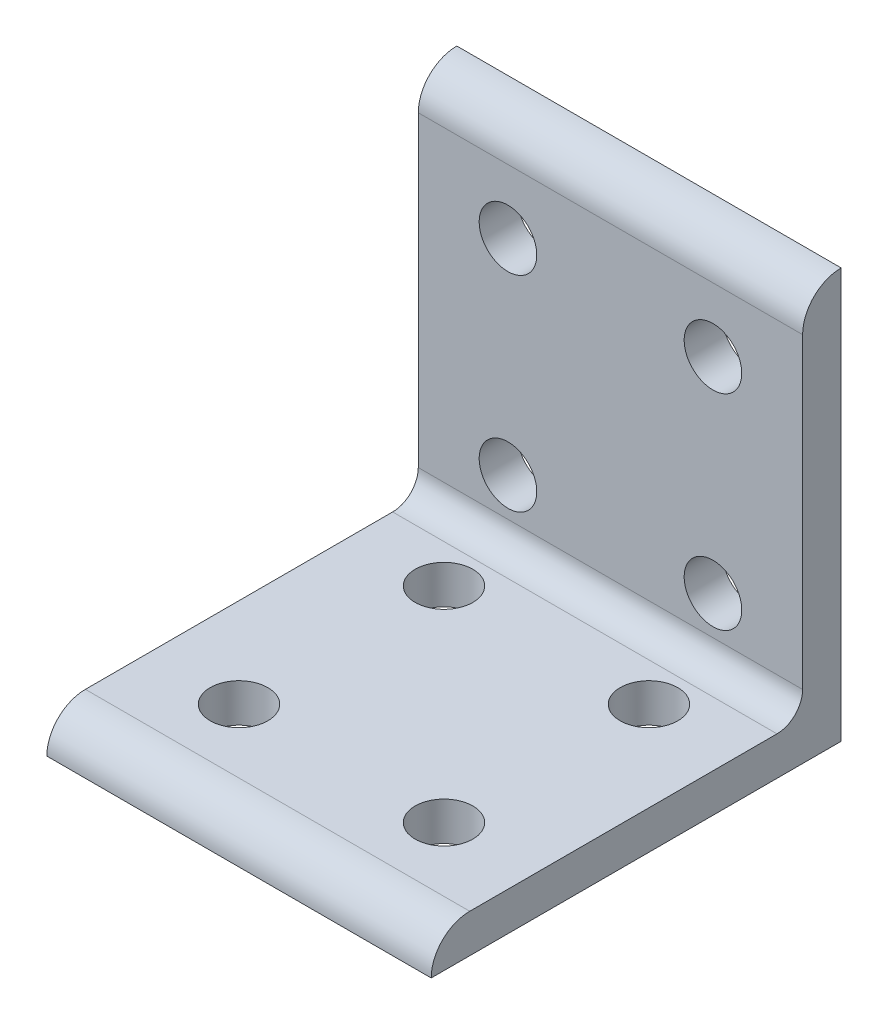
ISO-10303-21;
HEADER;
FILE_DESCRIPTION(('STEP AP214'),'2;1');
FILE_NAME('part.step','',(''),(''),'','','');
FILE_SCHEMA(('AUTOMOTIVE_DESIGN { 1 0 10303 214 1 1 1 1 }'));
ENDSEC;
DATA;
#1=APPLICATION_CONTEXT('core data for automotive mechanical design processes');
#2=APPLICATION_PROTOCOL_DEFINITION('international standard','automotive_design',2000,#1);
#3=PRODUCT_CONTEXT('',#1,'mechanical');
#4=PRODUCT('Part','Part','',(#3));
#5=PRODUCT_RELATED_PRODUCT_CATEGORY('part','',(#4));
#6=PRODUCT_DEFINITION_FORMATION('','',#4);
#7=PRODUCT_DEFINITION_CONTEXT('part definition',#1,'design');
#8=PRODUCT_DEFINITION('design','',#6,#7);
#9=PRODUCT_DEFINITION_SHAPE('','',#8);
#10=(LENGTH_UNIT() NAMED_UNIT(*) SI_UNIT(.MILLI.,.METRE.));
#11=(NAMED_UNIT(*) PLANE_ANGLE_UNIT() SI_UNIT($,.RADIAN.));
#12=(NAMED_UNIT(*) SI_UNIT($,.STERADIAN.) SOLID_ANGLE_UNIT());
#13=UNCERTAINTY_MEASURE_WITH_UNIT(LENGTH_MEASURE(1.E-05),#10,'distance_accuracy_value','');
#14=(GEOMETRIC_REPRESENTATION_CONTEXT(3) GLOBAL_UNCERTAINTY_ASSIGNED_CONTEXT((#13)) GLOBAL_UNIT_ASSIGNED_CONTEXT((#10,
#11,#12)) REPRESENTATION_CONTEXT('',''));
#15=CARTESIAN_POINT('',(0.,0.,0.));
#16=DIRECTION('',(0.,0.,1.));
#17=DIRECTION('',(1.,0.,0.));
#18=AXIS2_PLACEMENT_3D('',#15,#16,#17);
#19=CARTESIAN_POINT('',(23.8125,5.55111512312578E-13,0.));
#20=DIRECTION('',(0.,0.,1.));
#21=DIRECTION('',(1.,0.,0.));
#22=AXIS2_PLACEMENT_3D('',#19,#20,#21);
#23=PLANE('',#22);
#24=CARTESIAN_POINT('',(-12.7000000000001,38.1000000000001,2.77555756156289E-13));
#25=DIRECTION('',(0.,0.,1.));
#26=DIRECTION('',(1.,0.,0.));
#27=AXIS2_PLACEMENT_3D('',#24,#25,#26);
#28=CIRCLE('',#27,3.5687);
#29=CARTESIAN_POINT('',(-9.1313000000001,38.1000000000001,2.77555756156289E-13));
#30=VERTEX_POINT('',#29);
#31=EDGE_CURVE('E164',#30,#30,#28,.T.);
#32=ORIENTED_EDGE('',*,*,#31,.T.);
#33=EDGE_LOOP('',(#32));
#34=FACE_BOUND('',#33,.T.);
#35=CARTESIAN_POINT('',(12.7000000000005,38.1000000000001,2.77555756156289E-13));
#36=DIRECTION('',(0.,0.,1.));
#37=DIRECTION('',(1.,0.,0.));
#38=AXIS2_PLACEMENT_3D('',#35,#36,#37);
#39=CIRCLE('',#38,3.5687);
#40=CARTESIAN_POINT('',(16.2687000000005,38.1000000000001,2.77555756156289E-13));
#41=VERTEX_POINT('',#40);
#42=EDGE_CURVE('E119',#41,#41,#39,.T.);
#43=ORIENTED_EDGE('',*,*,#42,.T.);
#44=EDGE_LOOP('',(#43));
#45=FACE_BOUND('',#44,.T.);
#46=DIRECTION('',(-1.,0.,0.));
#47=VECTOR('',#46,1.);
#48=CARTESIAN_POINT('',(23.8125,5.55111512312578E-13,0.));
#49=LINE('',#48,#47);
#50=CARTESIAN_POINT('',(23.8125,5.55111512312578E-13,0.));
#51=VERTEX_POINT('',#50);
#52=CARTESIAN_POINT('',(-23.8125000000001,0.,0.));
#53=VERTEX_POINT('',#52);
#54=EDGE_CURVE('E44',#51,#53,#49,.T.);
#55=ORIENTED_EDGE('',*,*,#54,.T.);
#56=DIRECTION('',(0.,1.,0.));
#57=VECTOR('',#56,1.);
#58=CARTESIAN_POINT('',(-23.8125000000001,0.,0.));
#59=LINE('',#58,#57);
#60=CARTESIAN_POINT('',(-23.8125,50.8000000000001,0.));
#61=VERTEX_POINT('',#60);
#62=EDGE_CURVE('E113',#53,#61,#59,.T.);
#63=ORIENTED_EDGE('',*,*,#62,.T.);
#64=DIRECTION('',(-1.,0.,0.));
#65=VECTOR('',#64,1.);
#66=CARTESIAN_POINT('',(23.8125000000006,50.8000000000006,5.55111512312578E-13));
#67=LINE('',#66,#65);
#68=CARTESIAN_POINT('',(23.8125000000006,50.8000000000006,5.55111512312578E-13));
#69=VERTEX_POINT('',#68);
#70=EDGE_CURVE('E154',#69,#61,#67,.T.);
#71=ORIENTED_EDGE('',*,*,#70,.F.);
#72=DIRECTION('',(0.,1.,0.));
#73=VECTOR('',#72,1.);
#74=CARTESIAN_POINT('',(23.8125,5.55111512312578E-13,0.));
#75=LINE('',#74,#73);
#76=EDGE_CURVE('E139',#51,#69,#75,.T.);
#77=ORIENTED_EDGE('',*,*,#76,.F.);
#78=EDGE_LOOP('',(#55,#63,#71,#77));
#79=FACE_BOUND('',#78,.T.);
#80=CARTESIAN_POINT('',(-12.7000000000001,12.7,2.77555756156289E-13));
#81=DIRECTION('',(0.,0.,1.));
#82=DIRECTION('',(1.,0.,0.));
#83=AXIS2_PLACEMENT_3D('',#80,#81,#82);
#84=CIRCLE('',#83,3.5687);
#85=CARTESIAN_POINT('',(-9.13130000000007,12.7,2.77555756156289E-13));
#86=VERTEX_POINT('',#85);
#87=EDGE_CURVE('E160',#86,#86,#84,.T.);
#88=ORIENTED_EDGE('',*,*,#87,.T.);
#89=EDGE_LOOP('',(#88));
#90=FACE_BOUND('',#89,.T.);
#91=CARTESIAN_POINT('',(12.7000000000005,12.7000000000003,2.77555756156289E-13));
#92=DIRECTION('',(0.,0.,1.));
#93=DIRECTION('',(1.,0.,0.));
#94=AXIS2_PLACEMENT_3D('',#91,#92,#93);
#95=CIRCLE('',#94,3.5687);
#96=CARTESIAN_POINT('',(16.2687000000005,12.7000000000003,2.77555756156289E-13));
#97=VERTEX_POINT('',#96);
#98=EDGE_CURVE('E188',#97,#97,#95,.T.);
#99=ORIENTED_EDGE('',*,*,#98,.T.);
#100=EDGE_LOOP('',(#99));
#101=FACE_BOUND('',#100,.T.);
#102=ADVANCED_FACE('F35',(#34,#45,#79,#90,#101),#23,.F.);
#103=CARTESIAN_POINT('',(23.8125,46.0248000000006,4.77520000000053));
#104=DIRECTION('',(0.,0.,-1.));
#105=DIRECTION('',(-1.,0.,0.));
#106=AXIS2_PLACEMENT_3D('',#103,#104,#105);
#107=PLANE('',#106);
#108=CARTESIAN_POINT('',(-12.7000000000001,38.1000000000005,4.77520000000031));
#109=DIRECTION('',(0.,0.,-1.));
#110=DIRECTION('',(-1.,0.,0.));
#111=AXIS2_PLACEMENT_3D('',#108,#109,#110);
#112=CIRCLE('',#111,3.5687);
#113=CARTESIAN_POINT('',(-16.2687000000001,38.1000000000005,4.77520000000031));
#114=VERTEX_POINT('',#113);
#115=EDGE_CURVE('E161',#114,#114,#112,.F.);
#116=ORIENTED_EDGE('',*,*,#115,.F.);
#117=EDGE_LOOP('',(#116));
#118=FACE_BOUND('',#117,.T.);
#119=CARTESIAN_POINT('',(12.7,38.1000000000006,4.77520000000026));
#120=DIRECTION('',(0.,0.,-1.));
#121=DIRECTION('',(-1.,0.,0.));
#122=AXIS2_PLACEMENT_3D('',#119,#120,#121);
#123=CIRCLE('',#122,3.5687);
#124=CARTESIAN_POINT('',(9.13130000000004,38.1000000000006,4.77520000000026));
#125=VERTEX_POINT('',#124);
#126=EDGE_CURVE('E116',#125,#125,#123,.F.);
#127=ORIENTED_EDGE('',*,*,#126,.F.);
#128=EDGE_LOOP('',(#127));
#129=FACE_BOUND('',#128,.T.);
#130=DIRECTION('',(-1.,0.,0.));
#131=VECTOR('',#130,1.);
#132=CARTESIAN_POINT('',(23.8125,46.0248000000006,4.77520000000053));
#133=LINE('',#132,#131);
#134=CARTESIAN_POINT('',(23.8125,46.0248000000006,4.77520000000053));
#135=VERTEX_POINT('',#134);
#136=CARTESIAN_POINT('',(-23.8125000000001,46.0248000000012,4.77520000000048));
#137=VERTEX_POINT('',#136);
#138=EDGE_CURVE('E152',#135,#137,#133,.T.);
#139=ORIENTED_EDGE('',*,*,#138,.T.);
#140=DIRECTION('',(0.,-1.,0.));
#141=VECTOR('',#140,1.);
#142=CARTESIAN_POINT('',(-23.8125000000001,46.0248000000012,4.77520000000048));
#143=LINE('',#142,#141);
#144=CARTESIAN_POINT('',(-23.8125000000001,7.95020000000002,4.77519999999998));
#145=VERTEX_POINT('',#144);
#146=EDGE_CURVE('E128',#137,#145,#143,.T.);
#147=ORIENTED_EDGE('',*,*,#146,.T.);
#148=DIRECTION('',(-1.,0.,0.));
#149=VECTOR('',#148,1.);
#150=CARTESIAN_POINT('',(23.8125,7.95020000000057,4.77520000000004));
#151=LINE('',#150,#149);
#152=CARTESIAN_POINT('',(23.8125,7.95020000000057,4.77520000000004));
#153=VERTEX_POINT('',#152);
#154=EDGE_CURVE('E150',#153,#145,#151,.T.);
#155=ORIENTED_EDGE('',*,*,#154,.F.);
#156=DIRECTION('',(0.,-1.,0.));
#157=VECTOR('',#156,1.);
#158=CARTESIAN_POINT('',(23.8125,46.0248000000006,4.77520000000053));
#159=LINE('',#158,#157);
#160=EDGE_CURVE('E143',#135,#153,#159,.T.);
#161=ORIENTED_EDGE('',*,*,#160,.F.);
#162=EDGE_LOOP('',(#139,#147,#155,#161));
#163=FACE_BOUND('',#162,.T.);
#164=CARTESIAN_POINT('',(-12.7000000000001,12.7,4.77520000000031));
#165=DIRECTION('',(0.,0.,-1.));
#166=DIRECTION('',(-1.,0.,0.));
#167=AXIS2_PLACEMENT_3D('',#164,#165,#166);
#168=CIRCLE('',#167,3.5687);
#169=CARTESIAN_POINT('',(-16.2687000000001,12.7,4.77520000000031));
#170=VERTEX_POINT('',#169);
#171=EDGE_CURVE('E157',#170,#170,#168,.F.);
#172=ORIENTED_EDGE('',*,*,#171,.F.);
#173=EDGE_LOOP('',(#172));
#174=FACE_BOUND('',#173,.T.);
#175=CARTESIAN_POINT('',(12.7,12.7000000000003,4.77520000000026));
#176=DIRECTION('',(0.,0.,-1.));
#177=DIRECTION('',(-1.,0.,0.));
#178=AXIS2_PLACEMENT_3D('',#175,#176,#177);
#179=CIRCLE('',#178,3.5687);
#180=CARTESIAN_POINT('',(9.13130000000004,12.7000000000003,4.77520000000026));
#181=VERTEX_POINT('',#180);
#182=EDGE_CURVE('E39',#181,#181,#179,.F.);
#183=ORIENTED_EDGE('',*,*,#182,.F.);
#184=EDGE_LOOP('',(#183));
#185=FACE_BOUND('',#184,.T.);
#186=ADVANCED_FACE('F209',(#118,#129,#163,#174,#185),#107,.F.);
#187=CARTESIAN_POINT('',(23.8125000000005,5.55111512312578E-13,50.8000000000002));
#188=DIRECTION('',(0.,1.,0.));
#189=DIRECTION('',(0.,0.,1.));
#190=AXIS2_PLACEMENT_3D('',#187,#188,#189);
#191=PLANE('',#190);
#192=CARTESIAN_POINT('',(-12.7000000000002,0.,12.7));
#193=DIRECTION('',(0.,1.,0.));
#194=DIRECTION('',(0.,0.,1.));
#195=AXIS2_PLACEMENT_3D('',#192,#193,#194);
#196=CIRCLE('',#195,3.5687);
#197=CARTESIAN_POINT('',(-12.7000000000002,0.,16.2687));
#198=VERTEX_POINT('',#197);
#199=EDGE_CURVE('E175',#198,#198,#196,.T.);
#200=ORIENTED_EDGE('',*,*,#199,.T.);
#201=EDGE_LOOP('',(#200));
#202=FACE_BOUND('',#201,.T.);
#203=CARTESIAN_POINT('',(12.7000000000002,0.,12.6999999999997));
#204=DIRECTION('',(0.,1.,0.));
#205=DIRECTION('',(0.,0.,1.));
#206=AXIS2_PLACEMENT_3D('',#203,#204,#205);
#207=CIRCLE('',#206,3.5687);
#208=CARTESIAN_POINT('',(12.7000000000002,0.,16.2686999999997));
#209=VERTEX_POINT('',#208);
#210=EDGE_CURVE('E168',#209,#209,#207,.T.);
#211=ORIENTED_EDGE('',*,*,#210,.T.);
#212=EDGE_LOOP('',(#211));
#213=FACE_BOUND('',#212,.T.);
#214=DIRECTION('',(-1.,0.,0.));
#215=VECTOR('',#214,1.);
#216=CARTESIAN_POINT('',(23.8125000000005,5.55111512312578E-13,50.8000000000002));
#217=LINE('',#216,#215);
#218=CARTESIAN_POINT('',(23.8125000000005,5.55111512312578E-13,50.8000000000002));
#219=VERTEX_POINT('',#218);
#220=CARTESIAN_POINT('',(-23.8125,0.,50.8000000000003));
#221=VERTEX_POINT('',#220);
#222=EDGE_CURVE('E11',#219,#221,#217,.T.);
#223=ORIENTED_EDGE('',*,*,#222,.T.);
#224=DIRECTION('',(0.,0.,-1.));
#225=VECTOR('',#224,1.);
#226=CARTESIAN_POINT('',(-23.8125,0.,50.8000000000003));
#227=LINE('',#226,#225);
#228=EDGE_CURVE('E99',#221,#53,#227,.T.);
#229=ORIENTED_EDGE('',*,*,#228,.T.);
#230=ORIENTED_EDGE('',*,*,#54,.F.);
#231=DIRECTION('',(0.,0.,-1.));
#232=VECTOR('',#231,1.);
#233=CARTESIAN_POINT('',(23.8125000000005,5.55111512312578E-13,50.8000000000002));
#234=LINE('',#233,#232);
#235=EDGE_CURVE('E100',#219,#51,#234,.T.);
#236=ORIENTED_EDGE('',*,*,#235,.F.);
#237=EDGE_LOOP('',(#223,#229,#230,#236));
#238=FACE_BOUND('',#237,.T.);
#239=CARTESIAN_POINT('',(12.7000000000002,0.,38.1));
#240=DIRECTION('',(0.,1.,0.));
#241=DIRECTION('',(0.,0.,1.));
#242=AXIS2_PLACEMENT_3D('',#239,#240,#241);
#243=CIRCLE('',#242,3.5687);
#244=CARTESIAN_POINT('',(12.7000000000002,0.,41.6687));
#245=VERTEX_POINT('',#244);
#246=EDGE_CURVE('E172',#245,#245,#243,.T.);
#247=ORIENTED_EDGE('',*,*,#246,.T.);
#248=EDGE_LOOP('',(#247));
#249=FACE_BOUND('',#248,.T.);
#250=CARTESIAN_POINT('',(-12.7000000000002,2.77555756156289E-13,38.1000000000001));
#251=DIRECTION('',(0.,1.,0.));
#252=DIRECTION('',(0.,0.,1.));
#253=AXIS2_PLACEMENT_3D('',#250,#251,#252);
#254=CIRCLE('',#253,3.5687);
#255=CARTESIAN_POINT('',(-12.7000000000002,2.77555756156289E-13,41.6687000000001));
#256=VERTEX_POINT('',#255);
#257=EDGE_CURVE('E178',#256,#256,#254,.T.);
#258=ORIENTED_EDGE('',*,*,#257,.T.);
#259=EDGE_LOOP('',(#258));
#260=FACE_BOUND('',#259,.T.);
#261=ADVANCED_FACE('F96',(#202,#213,#238,#249,#260),#191,.F.);
#262=CARTESIAN_POINT('',(23.8125,4.77520000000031,7.95020000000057));
#263=DIRECTION('',(0.,-1.,0.));
#264=DIRECTION('',(0.,0.,-1.));
#265=AXIS2_PLACEMENT_3D('',#262,#263,#264);
#266=PLANE('',#265);
#267=CARTESIAN_POINT('',(-12.7000000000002,4.77519999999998,12.7000000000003));
#268=DIRECTION('',(0.,-1.,0.));
#269=DIRECTION('',(0.,0.,-1.));
#270=AXIS2_PLACEMENT_3D('',#267,#268,#269);
#271=CIRCLE('',#270,3.5687);
#272=CARTESIAN_POINT('',(-12.7000000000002,4.77519999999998,9.13130000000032));
#273=VERTEX_POINT('',#272);
#274=EDGE_CURVE('E173',#273,#273,#271,.F.);
#275=ORIENTED_EDGE('',*,*,#274,.F.);
#276=EDGE_LOOP('',(#275));
#277=FACE_BOUND('',#276,.T.);
#278=CARTESIAN_POINT('',(12.7000000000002,4.77519999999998,12.7000000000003));
#279=DIRECTION('',(0.,-1.,0.));
#280=DIRECTION('',(0.,0.,-1.));
#281=AXIS2_PLACEMENT_3D('',#278,#279,#280);
#282=CIRCLE('',#281,3.5687);
#283=CARTESIAN_POINT('',(12.7000000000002,4.77519999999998,9.13130000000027));
#284=VERTEX_POINT('',#283);
#285=EDGE_CURVE('E165',#284,#284,#282,.F.);
#286=ORIENTED_EDGE('',*,*,#285,.F.);
#287=EDGE_LOOP('',(#286));
#288=FACE_BOUND('',#287,.T.);
#289=DIRECTION('',(-1.,0.,0.));
#290=VECTOR('',#289,1.);
#291=CARTESIAN_POINT('',(23.8125,4.77520000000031,7.95020000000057));
#292=LINE('',#291,#290);
#293=CARTESIAN_POINT('',(23.8125,4.77520000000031,7.95020000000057));
#294=VERTEX_POINT('',#293);
#295=CARTESIAN_POINT('',(-23.8125000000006,4.77519999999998,7.95020000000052));
#296=VERTEX_POINT('',#295);
#297=EDGE_CURVE('E148',#294,#296,#292,.T.);
#298=ORIENTED_EDGE('',*,*,#297,.T.);
#299=DIRECTION('',(0.,0.,1.));
#300=VECTOR('',#299,1.);
#301=CARTESIAN_POINT('',(-23.8125000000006,4.77519999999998,7.95020000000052));
#302=LINE('',#301,#300);
#303=CARTESIAN_POINT('',(-23.8125000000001,4.77519999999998,46.0248));
#304=VERTEX_POINT('',#303);
#305=EDGE_CURVE('E134',#296,#304,#302,.T.);
#306=ORIENTED_EDGE('',*,*,#305,.T.);
#307=DIRECTION('',(-1.,0.,0.));
#308=VECTOR('',#307,1.);
#309=CARTESIAN_POINT('',(23.8125,4.77520000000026,46.0248));
#310=LINE('',#309,#308);
#311=CARTESIAN_POINT('',(23.8125,4.77520000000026,46.0248));
#312=VERTEX_POINT('',#311);
#313=EDGE_CURVE('E115',#312,#304,#310,.T.);
#314=ORIENTED_EDGE('',*,*,#313,.F.);
#315=DIRECTION('',(0.,0.,1.));
#316=VECTOR('',#315,1.);
#317=CARTESIAN_POINT('',(23.8125,4.77520000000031,7.95020000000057));
#318=LINE('',#317,#316);
#319=EDGE_CURVE('E52',#294,#312,#318,.T.);
#320=ORIENTED_EDGE('',*,*,#319,.F.);
#321=EDGE_LOOP('',(#298,#306,#314,#320));
#322=FACE_BOUND('',#321,.T.);
#323=CARTESIAN_POINT('',(12.7000000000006,4.77520000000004,38.1));
#324=DIRECTION('',(0.,-1.,0.));
#325=DIRECTION('',(0.,0.,-1.));
#326=AXIS2_PLACEMENT_3D('',#323,#324,#325);
#327=CIRCLE('',#326,3.5687);
#328=CARTESIAN_POINT('',(12.7000000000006,4.77520000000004,34.5313));
#329=VERTEX_POINT('',#328);
#330=EDGE_CURVE('E169',#329,#329,#327,.F.);
#331=ORIENTED_EDGE('',*,*,#330,.F.);
#332=EDGE_LOOP('',(#331));
#333=FACE_BOUND('',#332,.T.);
#334=CARTESIAN_POINT('',(-12.7,4.77520000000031,38.0999999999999));
#335=DIRECTION('',(0.,-1.,0.));
#336=DIRECTION('',(0.,0.,-1.));
#337=AXIS2_PLACEMENT_3D('',#334,#335,#336);
#338=CIRCLE('',#337,3.5687);
#339=CARTESIAN_POINT('',(-12.7,4.77520000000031,34.5312999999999));
#340=VERTEX_POINT('',#339);
#341=EDGE_CURVE('E176',#340,#340,#338,.F.);
#342=ORIENTED_EDGE('',*,*,#341,.F.);
#343=EDGE_LOOP('',(#342));
#344=FACE_BOUND('',#343,.T.);
#345=ADVANCED_FACE('F237',(#277,#288,#322,#333,#344),#266,.F.);
#346=CARTESIAN_POINT('',(23.8125,2.77555756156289E-13,46.0248000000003));
#347=DIRECTION('',(-1.,0.,0.));
#348=DIRECTION('',(0.,0.,1.));
#349=AXIS2_PLACEMENT_3D('',#346,#347,#348);
#350=CYLINDRICAL_SURFACE('',#349,4.7752);
#351=ORIENTED_EDGE('',*,*,#313,.T.);
#352=CARTESIAN_POINT('',(-23.8125000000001,0.,46.0248000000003));
#353=DIRECTION('',(1.,0.,0.));
#354=DIRECTION('',(0.,0.,-1.));
#355=AXIS2_PLACEMENT_3D('',#352,#353,#354);
#356=CIRCLE('',#355,4.7752);
#357=EDGE_CURVE('E109',#304,#221,#356,.T.);
#358=ORIENTED_EDGE('',*,*,#357,.T.);
#359=ORIENTED_EDGE('',*,*,#222,.F.);
#360=CARTESIAN_POINT('',(23.8125,2.77555756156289E-13,46.0248000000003));
#361=DIRECTION('',(1.,0.,0.));
#362=DIRECTION('',(0.,0.,-1.));
#363=AXIS2_PLACEMENT_3D('',#360,#361,#362);
#364=CIRCLE('',#363,4.7752);
#365=EDGE_CURVE('E136',#312,#219,#364,.T.);
#366=ORIENTED_EDGE('',*,*,#365,.F.);
#367=EDGE_LOOP('',(#351,#358,#359,#366));
#368=FACE_BOUND('',#367,.T.);
#369=ADVANCED_FACE('F37',(#368),#350,.T.);
#370=CARTESIAN_POINT('',(23.8125,46.0248000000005,2.77555756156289E-13));
#371=DIRECTION('',(-1.,0.,0.));
#372=DIRECTION('',(0.,0.,1.));
#373=AXIS2_PLACEMENT_3D('',#370,#371,#372);
#374=CYLINDRICAL_SURFACE('',#373,4.77520000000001);
#375=ORIENTED_EDGE('',*,*,#70,.T.);
#376=CARTESIAN_POINT('',(-23.8125000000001,46.0248,2.77555756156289E-13));
#377=DIRECTION('',(1.,0.,0.));
#378=DIRECTION('',(0.,0.,-1.));
#379=AXIS2_PLACEMENT_3D('',#376,#377,#378);
#380=CIRCLE('',#379,4.77520000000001);
#381=EDGE_CURVE('E125',#61,#137,#380,.T.);
#382=ORIENTED_EDGE('',*,*,#381,.T.);
#383=ORIENTED_EDGE('',*,*,#138,.F.);
#384=CARTESIAN_POINT('',(23.8125,46.0248000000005,2.77555756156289E-13));
#385=DIRECTION('',(1.,0.,0.));
#386=DIRECTION('',(0.,0.,-1.));
#387=AXIS2_PLACEMENT_3D('',#384,#385,#386);
#388=CIRCLE('',#387,4.77520000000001);
#389=EDGE_CURVE('E141',#69,#135,#388,.T.);
#390=ORIENTED_EDGE('',*,*,#389,.F.);
#391=EDGE_LOOP('',(#375,#382,#383,#390));
#392=FACE_BOUND('',#391,.T.);
#393=ADVANCED_FACE('F235',(#392),#374,.T.);
#394=CARTESIAN_POINT('',(23.8125,7.95020000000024,7.95019999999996));
#395=DIRECTION('',(-1.,0.,0.));
#396=DIRECTION('',(0.,0.,1.));
#397=AXIS2_PLACEMENT_3D('',#394,#395,#396);
#398=CYLINDRICAL_SURFACE('',#397,3.17499999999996);
#399=ORIENTED_EDGE('',*,*,#154,.T.);
#400=CARTESIAN_POINT('',(-23.8125000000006,7.95019999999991,7.95020000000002));
#401=DIRECTION('',(-1.,0.,0.));
#402=DIRECTION('',(0.,0.,1.));
#403=AXIS2_PLACEMENT_3D('',#400,#401,#402);
#404=CIRCLE('',#403,3.17499999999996);
#405=EDGE_CURVE('E131',#145,#296,#404,.T.);
#406=ORIENTED_EDGE('',*,*,#405,.T.);
#407=ORIENTED_EDGE('',*,*,#297,.F.);
#408=CARTESIAN_POINT('',(23.8125,7.95020000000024,7.95019999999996));
#409=DIRECTION('',(-1.,0.,0.));
#410=DIRECTION('',(0.,0.,1.));
#411=AXIS2_PLACEMENT_3D('',#408,#409,#410);
#412=CIRCLE('',#411,3.17499999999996);
#413=EDGE_CURVE('E57',#153,#294,#412,.T.);
#414=ORIENTED_EDGE('',*,*,#413,.F.);
#415=EDGE_LOOP('',(#399,#406,#407,#414));
#416=FACE_BOUND('',#415,.T.);
#417=ADVANCED_FACE('F280',(#416),#398,.F.);
#418=CARTESIAN_POINT('',(23.8125,2.77555756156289E-13,46.0248000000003));
#419=DIRECTION('',(1.,0.,0.));
#420=DIRECTION('',(0.,0.,-1.));
#421=AXIS2_PLACEMENT_3D('',#418,#419,#420);
#422=PLANE('',#421);
#423=ORIENTED_EDGE('',*,*,#365,.T.);
#424=ORIENTED_EDGE('',*,*,#235,.T.);
#425=ORIENTED_EDGE('',*,*,#76,.T.);
#426=ORIENTED_EDGE('',*,*,#389,.T.);
#427=ORIENTED_EDGE('',*,*,#160,.T.);
#428=ORIENTED_EDGE('',*,*,#413,.T.);
#429=ORIENTED_EDGE('',*,*,#319,.T.);
#430=EDGE_LOOP('',(#423,#424,#425,#426,#427,#428,#429));
#431=FACE_BOUND('',#430,.T.);
#432=ADVANCED_FACE('F278',(#431),#422,.T.);
#433=CARTESIAN_POINT('',(-23.8125000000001,0.,46.0248000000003));
#434=DIRECTION('',(1.,0.,0.));
#435=DIRECTION('',(0.,0.,-1.));
#436=AXIS2_PLACEMENT_3D('',#433,#434,#435);
#437=PLANE('',#436);
#438=ORIENTED_EDGE('',*,*,#357,.F.);
#439=ORIENTED_EDGE('',*,*,#305,.F.);
#440=ORIENTED_EDGE('',*,*,#405,.F.);
#441=ORIENTED_EDGE('',*,*,#146,.F.);
#442=ORIENTED_EDGE('',*,*,#381,.F.);
#443=ORIENTED_EDGE('',*,*,#62,.F.);
#444=ORIENTED_EDGE('',*,*,#228,.F.);
#445=EDGE_LOOP('',(#438,#439,#440,#441,#442,#443,#444));
#446=FACE_BOUND('',#445,.T.);
#447=ADVANCED_FACE('F107',(#446),#437,.F.);
#448=CARTESIAN_POINT('',(12.7,38.1000000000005,5.25272000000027));
#449=DIRECTION('',(0.,0.,-1.));
#450=DIRECTION('',(-1.,0.,0.));
#451=AXIS2_PLACEMENT_3D('',#448,#449,#450);
#452=CYLINDRICAL_SURFACE('',#451,3.5687);
#453=ORIENTED_EDGE('',*,*,#42,.F.);
#454=EDGE_LOOP('',(#453));
#455=FACE_BOUND('',#454,.T.);
#456=ORIENTED_EDGE('',*,*,#126,.T.);
#457=EDGE_LOOP('',(#456));
#458=FACE_BOUND('',#457,.T.);
#459=ADVANCED_FACE('F205',(#455,#458),#452,.F.);
#460=CARTESIAN_POINT('',(-12.7000000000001,12.7,5.25272000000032));
#461=DIRECTION('',(0.,0.,-1.));
#462=DIRECTION('',(-1.,0.,0.));
#463=AXIS2_PLACEMENT_3D('',#460,#461,#462);
#464=CYLINDRICAL_SURFACE('',#463,3.5687);
#465=ORIENTED_EDGE('',*,*,#87,.F.);
#466=EDGE_LOOP('',(#465));
#467=FACE_BOUND('',#466,.T.);
#468=ORIENTED_EDGE('',*,*,#171,.T.);
#469=EDGE_LOOP('',(#468));
#470=FACE_BOUND('',#469,.T.);
#471=ADVANCED_FACE('F201',(#467,#470),#464,.F.);
#472=CARTESIAN_POINT('',(-12.7000000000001,38.1000000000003,5.25272000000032));
#473=DIRECTION('',(0.,0.,-1.));
#474=DIRECTION('',(-1.,0.,0.));
#475=AXIS2_PLACEMENT_3D('',#472,#473,#474);
#476=CYLINDRICAL_SURFACE('',#475,3.5687);
#477=ORIENTED_EDGE('',*,*,#31,.F.);
#478=EDGE_LOOP('',(#477));
#479=FACE_BOUND('',#478,.T.);
#480=ORIENTED_EDGE('',*,*,#115,.T.);
#481=EDGE_LOOP('',(#480));
#482=FACE_BOUND('',#481,.T.);
#483=ADVANCED_FACE('F204',(#479,#482),#476,.F.);
#484=CARTESIAN_POINT('',(12.7000000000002,5.25271999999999,12.7000000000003));
#485=DIRECTION('',(0.,-1.,0.));
#486=DIRECTION('',(0.,0.,-1.));
#487=AXIS2_PLACEMENT_3D('',#484,#485,#486);
#488=CYLINDRICAL_SURFACE('',#487,3.5687);
#489=ORIENTED_EDGE('',*,*,#210,.F.);
#490=EDGE_LOOP('',(#489));
#491=FACE_BOUND('',#490,.T.);
#492=ORIENTED_EDGE('',*,*,#285,.T.);
#493=EDGE_LOOP('',(#492));
#494=FACE_BOUND('',#493,.T.);
#495=ADVANCED_FACE('F248',(#491,#494),#488,.F.);
#496=CARTESIAN_POINT('',(12.7000000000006,5.25272000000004,38.1));
#497=DIRECTION('',(0.,-1.,0.));
#498=DIRECTION('',(0.,0.,-1.));
#499=AXIS2_PLACEMENT_3D('',#496,#497,#498);
#500=CYLINDRICAL_SURFACE('',#499,3.5687);
#501=ORIENTED_EDGE('',*,*,#246,.F.);
#502=EDGE_LOOP('',(#501));
#503=FACE_BOUND('',#502,.T.);
#504=ORIENTED_EDGE('',*,*,#330,.T.);
#505=EDGE_LOOP('',(#504));
#506=FACE_BOUND('',#505,.T.);
#507=ADVANCED_FACE('F251',(#503,#506),#500,.F.);
#508=CARTESIAN_POINT('',(-12.7000000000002,5.25271999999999,12.7000000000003));
#509=DIRECTION('',(0.,-1.,0.));
#510=DIRECTION('',(0.,0.,-1.));
#511=AXIS2_PLACEMENT_3D('',#508,#509,#510);
#512=CYLINDRICAL_SURFACE('',#511,3.5687);
#513=ORIENTED_EDGE('',*,*,#199,.F.);
#514=EDGE_LOOP('',(#513));
#515=FACE_BOUND('',#514,.T.);
#516=ORIENTED_EDGE('',*,*,#274,.T.);
#517=EDGE_LOOP('',(#516));
#518=FACE_BOUND('',#517,.T.);
#519=ADVANCED_FACE('F224',(#515,#518),#512,.F.);
#520=CARTESIAN_POINT('',(-12.7,5.25272000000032,38.1));
#521=DIRECTION('',(0.,-1.,0.));
#522=DIRECTION('',(0.,0.,-1.));
#523=AXIS2_PLACEMENT_3D('',#520,#521,#522);
#524=CYLINDRICAL_SURFACE('',#523,3.5687);
#525=ORIENTED_EDGE('',*,*,#257,.F.);
#526=EDGE_LOOP('',(#525));
#527=FACE_BOUND('',#526,.T.);
#528=ORIENTED_EDGE('',*,*,#341,.T.);
#529=EDGE_LOOP('',(#528));
#530=FACE_BOUND('',#529,.T.);
#531=ADVANCED_FACE('F218',(#527,#530),#524,.F.);
#532=CARTESIAN_POINT('',(12.7,12.7000000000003,5.25272000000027));
#533=DIRECTION('',(0.,0.,-1.));
#534=DIRECTION('',(-1.,0.,0.));
#535=AXIS2_PLACEMENT_3D('',#532,#533,#534);
#536=CYLINDRICAL_SURFACE('',#535,3.5687);
#537=ORIENTED_EDGE('',*,*,#98,.F.);
#538=EDGE_LOOP('',(#537));
#539=FACE_BOUND('',#538,.T.);
#540=ORIENTED_EDGE('',*,*,#182,.T.);
#541=EDGE_LOOP('',(#540));
#542=FACE_BOUND('',#541,.T.);
#543=ADVANCED_FACE('F216',(#539,#542),#536,.F.);
#544=CLOSED_SHELL('',(#102,#186,#261,#345,#369,#393,#417,#432,#447,#459,#471,#483,#495,#507,
#519,#531,#543));
#545=MANIFOLD_SOLID_BREP('B2',#544);
#546=ADVANCED_BREP_SHAPE_REPRESENTATION('',(#18,#545),#14);
#547=SHAPE_DEFINITION_REPRESENTATION(#9,#546);
ENDSEC;
END-ISO-10303-21;
